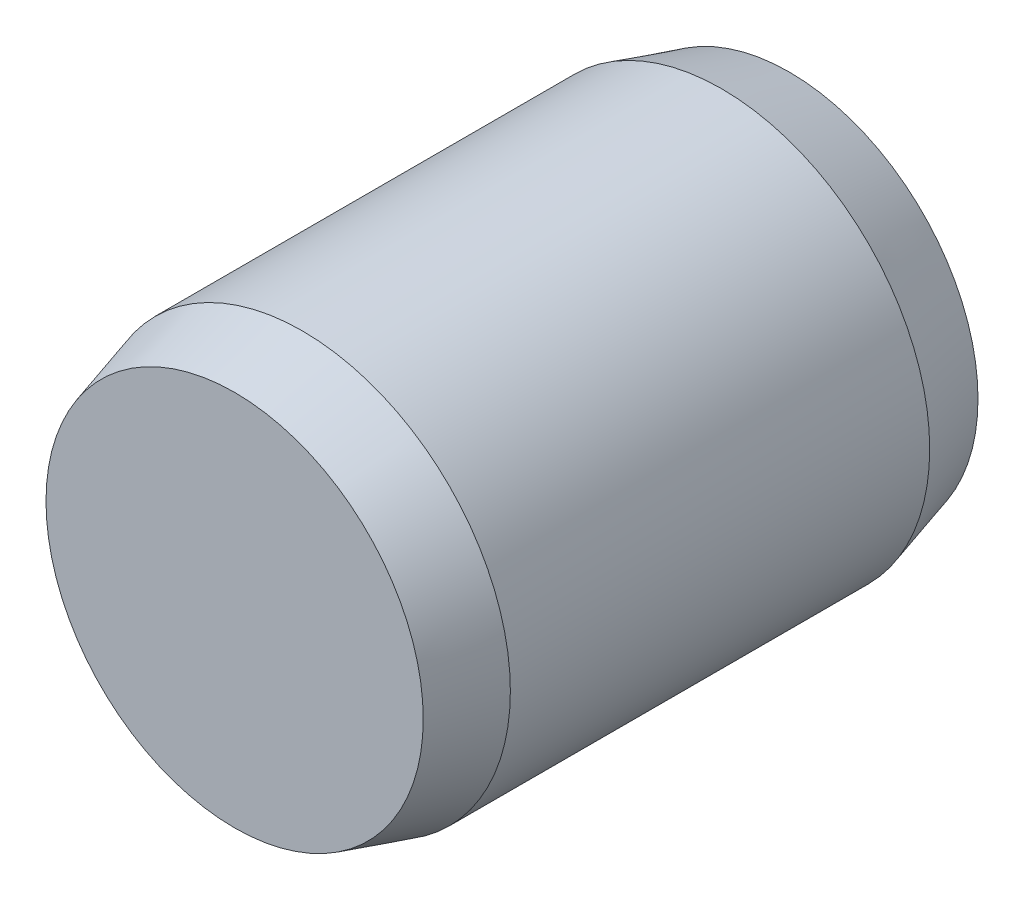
from build123d import *


with BuildPart() as part:
    # Sketch3 → Revolve1 (revolve)
    with BuildSketch(Plane(origin=(0, 0, 0), x_dir=(0, 0, -1), z_dir=(1, 0, 0)), mode=Mode.PRIVATE) as revolve1_sk:
        Polygon((-3.175, 0), (3.175, 0), (3.175, 2.159), (2.39992214, 2.38125), (-2.39992214, 2.38125), (-3.175, 2.159), align=None)
    revolve(revolve1_sk.sketch.rotate(Axis((0, 0, 3.175), (0, 0, -1)), 90), axis=Axis((0, 0, 3.175), (0, 0, -1)))


solid = part.part
